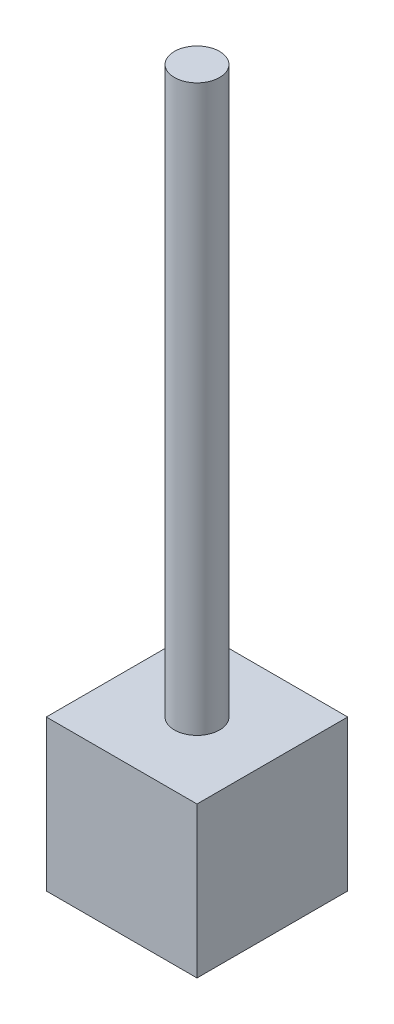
ISO-10303-21;
HEADER;
FILE_DESCRIPTION(('STEP AP214'),'2;1');
FILE_NAME('part.step','',(''),(''),'','','');
FILE_SCHEMA(('AUTOMOTIVE_DESIGN { 1 0 10303 214 1 1 1 1 }'));
ENDSEC;
DATA;
#1=APPLICATION_CONTEXT('core data for automotive mechanical design processes');
#2=APPLICATION_PROTOCOL_DEFINITION('international standard','automotive_design',2000,#1);
#3=PRODUCT_CONTEXT('',#1,'mechanical');
#4=PRODUCT('Part','Part','',(#3));
#5=PRODUCT_RELATED_PRODUCT_CATEGORY('part','',(#4));
#6=PRODUCT_DEFINITION_FORMATION('','',#4);
#7=PRODUCT_DEFINITION_CONTEXT('part definition',#1,'design');
#8=PRODUCT_DEFINITION('design','',#6,#7);
#9=PRODUCT_DEFINITION_SHAPE('','',#8);
#10=(LENGTH_UNIT() NAMED_UNIT(*) SI_UNIT(.MILLI.,.METRE.));
#11=(NAMED_UNIT(*) PLANE_ANGLE_UNIT() SI_UNIT($,.RADIAN.));
#12=(NAMED_UNIT(*) SI_UNIT($,.STERADIAN.) SOLID_ANGLE_UNIT());
#13=UNCERTAINTY_MEASURE_WITH_UNIT(LENGTH_MEASURE(1.E-05),#10,'distance_accuracy_value','');
#14=(GEOMETRIC_REPRESENTATION_CONTEXT(3) GLOBAL_UNCERTAINTY_ASSIGNED_CONTEXT((#13)) GLOBAL_UNIT_ASSIGNED_CONTEXT((#10,
#11,#12)) REPRESENTATION_CONTEXT('',''));
#15=CARTESIAN_POINT('',(0.,0.,0.));
#16=DIRECTION('',(0.,0.,1.));
#17=DIRECTION('',(1.,0.,0.));
#18=AXIS2_PLACEMENT_3D('',#15,#16,#17);
#19=CARTESIAN_POINT('',(0.,40.,40.));
#20=DIRECTION('',(0.,-1.,0.));
#21=DIRECTION('',(0.,0.,-1.));
#22=AXIS2_PLACEMENT_3D('',#19,#20,#21);
#23=PLANE('',#22);
#24=DIRECTION('',(-1.,0.,0.));
#25=VECTOR('',#24,1.);
#26=CARTESIAN_POINT('',(0.,40.,0.));
#27=LINE('',#26,#25);
#28=CARTESIAN_POINT('',(40.,40.,0.));
#29=VERTEX_POINT('',#28);
#30=CARTESIAN_POINT('',(0.,40.,0.));
#31=VERTEX_POINT('',#30);
#32=EDGE_CURVE('E94',#29,#31,#27,.T.);
#33=ORIENTED_EDGE('',*,*,#32,.T.);
#34=DIRECTION('',(0.,0.,-1.));
#35=VECTOR('',#34,1.);
#36=CARTESIAN_POINT('',(0.,40.,40.));
#37=LINE('',#36,#35);
#38=CARTESIAN_POINT('',(0.,40.,40.));
#39=VERTEX_POINT('',#38);
#40=EDGE_CURVE('E87',#39,#31,#37,.T.);
#41=ORIENTED_EDGE('',*,*,#40,.F.);
#42=DIRECTION('',(-1.,0.,0.));
#43=VECTOR('',#42,1.);
#44=CARTESIAN_POINT('',(0.,40.,40.));
#45=LINE('',#44,#43);
#46=CARTESIAN_POINT('',(40.,40.,40.));
#47=VERTEX_POINT('',#46);
#48=EDGE_CURVE('E43',#47,#39,#45,.T.);
#49=ORIENTED_EDGE('',*,*,#48,.F.);
#50=DIRECTION('',(0.,0.,-1.));
#51=VECTOR('',#50,1.);
#52=CARTESIAN_POINT('',(40.,40.,40.));
#53=LINE('',#52,#51);
#54=EDGE_CURVE('E102',#47,#29,#53,.T.);
#55=ORIENTED_EDGE('',*,*,#54,.T.);
#56=EDGE_LOOP('',(#33,#41,#49,#55));
#57=FACE_BOUND('',#56,.T.);
#58=CARTESIAN_POINT('',(20.,40.,20.));
#59=DIRECTION('',(0.,-1.,0.));
#60=DIRECTION('',(0.,0.,-1.));
#61=AXIS2_PLACEMENT_3D('',#58,#59,#60);
#62=CIRCLE('',#61,6.);
#63=CARTESIAN_POINT('',(20.,40.,14.));
#64=VERTEX_POINT('',#63);
#65=EDGE_CURVE('E11',#64,#64,#62,.F.);
#66=ORIENTED_EDGE('',*,*,#65,.F.);
#67=EDGE_LOOP('',(#66));
#68=FACE_BOUND('',#67,.T.);
#69=ADVANCED_FACE('F28',(#57,#68),#23,.F.);
#70=CARTESIAN_POINT('',(0.,0.,40.));
#71=DIRECTION('',(1.,0.,0.));
#72=DIRECTION('',(0.,0.,-1.));
#73=AXIS2_PLACEMENT_3D('',#70,#71,#72);
#74=PLANE('',#73);
#75=DIRECTION('',(0.,-1.,0.));
#76=VECTOR('',#75,1.);
#77=CARTESIAN_POINT('',(0.,0.,0.));
#78=LINE('',#77,#76);
#79=CARTESIAN_POINT('',(0.,0.,0.));
#80=VERTEX_POINT('',#79);
#81=EDGE_CURVE('E74',#31,#80,#78,.T.);
#82=ORIENTED_EDGE('',*,*,#81,.T.);
#83=DIRECTION('',(0.,0.,-1.));
#84=VECTOR('',#83,1.);
#85=CARTESIAN_POINT('',(0.,0.,40.));
#86=LINE('',#85,#84);
#87=CARTESIAN_POINT('',(0.,0.,40.));
#88=VERTEX_POINT('',#87);
#89=EDGE_CURVE('E36',#88,#80,#86,.T.);
#90=ORIENTED_EDGE('',*,*,#89,.F.);
#91=DIRECTION('',(0.,-1.,0.));
#92=VECTOR('',#91,1.);
#93=CARTESIAN_POINT('',(0.,0.,40.));
#94=LINE('',#93,#92);
#95=EDGE_CURVE('E96',#39,#88,#94,.T.);
#96=ORIENTED_EDGE('',*,*,#95,.F.);
#97=ORIENTED_EDGE('',*,*,#40,.T.);
#98=EDGE_LOOP('',(#82,#90,#96,#97));
#99=FACE_BOUND('',#98,.T.);
#100=ADVANCED_FACE('F30',(#99),#74,.F.);
#101=CARTESIAN_POINT('',(0.,0.,40.));
#102=DIRECTION('',(0.,1.,0.));
#103=DIRECTION('',(0.,0.,1.));
#104=AXIS2_PLACEMENT_3D('',#101,#102,#103);
#105=PLANE('',#104);
#106=DIRECTION('',(1.,0.,0.));
#107=VECTOR('',#106,1.);
#108=CARTESIAN_POINT('',(0.,0.,0.));
#109=LINE('',#108,#107);
#110=CARTESIAN_POINT('',(40.,0.,0.));
#111=VERTEX_POINT('',#110);
#112=EDGE_CURVE('E69',#80,#111,#109,.T.);
#113=ORIENTED_EDGE('',*,*,#112,.T.);
#114=DIRECTION('',(0.,0.,-1.));
#115=VECTOR('',#114,1.);
#116=CARTESIAN_POINT('',(40.,0.,40.));
#117=LINE('',#116,#115);
#118=CARTESIAN_POINT('',(40.,0.,40.));
#119=VERTEX_POINT('',#118);
#120=EDGE_CURVE('E85',#119,#111,#117,.T.);
#121=ORIENTED_EDGE('',*,*,#120,.F.);
#122=DIRECTION('',(1.,0.,0.));
#123=VECTOR('',#122,1.);
#124=CARTESIAN_POINT('',(0.,0.,40.));
#125=LINE('',#124,#123);
#126=EDGE_CURVE('E82',#88,#119,#125,.T.);
#127=ORIENTED_EDGE('',*,*,#126,.F.);
#128=ORIENTED_EDGE('',*,*,#89,.T.);
#129=EDGE_LOOP('',(#113,#121,#127,#128));
#130=FACE_BOUND('',#129,.T.);
#131=ADVANCED_FACE('F81',(#130),#105,.F.);
#132=CARTESIAN_POINT('',(40.,0.,40.));
#133=DIRECTION('',(-1.,0.,0.));
#134=DIRECTION('',(0.,0.,1.));
#135=AXIS2_PLACEMENT_3D('',#132,#133,#134);
#136=PLANE('',#135);
#137=DIRECTION('',(0.,1.,0.));
#138=VECTOR('',#137,1.);
#139=CARTESIAN_POINT('',(40.,0.,0.));
#140=LINE('',#139,#138);
#141=EDGE_CURVE('E75',#111,#29,#140,.T.);
#142=ORIENTED_EDGE('',*,*,#141,.T.);
#143=ORIENTED_EDGE('',*,*,#54,.F.);
#144=DIRECTION('',(0.,1.,0.));
#145=VECTOR('',#144,1.);
#146=CARTESIAN_POINT('',(40.,0.,40.));
#147=LINE('',#146,#145);
#148=EDGE_CURVE('E48',#119,#47,#147,.T.);
#149=ORIENTED_EDGE('',*,*,#148,.F.);
#150=ORIENTED_EDGE('',*,*,#120,.T.);
#151=EDGE_LOOP('',(#142,#143,#149,#150));
#152=FACE_BOUND('',#151,.T.);
#153=ADVANCED_FACE('F106',(#152),#136,.F.);
#154=CARTESIAN_POINT('',(0.,40.,40.));
#155=DIRECTION('',(0.,0.,-1.));
#156=DIRECTION('',(-1.,0.,0.));
#157=AXIS2_PLACEMENT_3D('',#154,#155,#156);
#158=PLANE('',#157);
#159=ORIENTED_EDGE('',*,*,#95,.T.);
#160=ORIENTED_EDGE('',*,*,#126,.T.);
#161=ORIENTED_EDGE('',*,*,#148,.T.);
#162=ORIENTED_EDGE('',*,*,#48,.T.);
#163=EDGE_LOOP('',(#159,#160,#161,#162));
#164=FACE_BOUND('',#163,.T.);
#165=ADVANCED_FACE('F109',(#164),#158,.F.);
#166=CARTESIAN_POINT('',(0.,40.,0.));
#167=DIRECTION('',(0.,0.,-1.));
#168=DIRECTION('',(-1.,0.,0.));
#169=AXIS2_PLACEMENT_3D('',#166,#167,#168);
#170=PLANE('',#169);
#171=ORIENTED_EDGE('',*,*,#81,.F.);
#172=ORIENTED_EDGE('',*,*,#32,.F.);
#173=ORIENTED_EDGE('',*,*,#141,.F.);
#174=ORIENTED_EDGE('',*,*,#112,.F.);
#175=EDGE_LOOP('',(#171,#172,#173,#174));
#176=FACE_BOUND('',#175,.T.);
#177=ADVANCED_FACE('F71',(#176),#170,.T.);
#178=CARTESIAN_POINT('',(20.,190.,20.));
#179=DIRECTION('',(0.,-1.,0.));
#180=DIRECTION('',(0.,0.,-1.));
#181=AXIS2_PLACEMENT_3D('',#178,#179,#180);
#182=CYLINDRICAL_SURFACE('',#181,6.);
#183=CARTESIAN_POINT('',(20.,190.,20.));
#184=DIRECTION('',(0.,1.,0.));
#185=DIRECTION('',(0.,0.,1.));
#186=AXIS2_PLACEMENT_3D('',#183,#184,#185);
#187=CIRCLE('',#186,6.);
#188=CARTESIAN_POINT('',(20.,190.,26.));
#189=VERTEX_POINT('',#188);
#190=EDGE_CURVE('E88',#189,#189,#187,.T.);
#191=ORIENTED_EDGE('',*,*,#190,.F.);
#192=EDGE_LOOP('',(#191));
#193=FACE_BOUND('',#192,.T.);
#194=ORIENTED_EDGE('',*,*,#65,.T.);
#195=EDGE_LOOP('',(#194));
#196=FACE_BOUND('',#195,.T.);
#197=ADVANCED_FACE('F116',(#193,#196),#182,.T.);
#198=CARTESIAN_POINT('',(20.,190.,20.));
#199=DIRECTION('',(0.,1.,0.));
#200=DIRECTION('',(0.,0.,1.));
#201=AXIS2_PLACEMENT_3D('',#198,#199,#200);
#202=PLANE('',#201);
#203=ORIENTED_EDGE('',*,*,#190,.T.);
#204=EDGE_LOOP('',(#203));
#205=FACE_BOUND('',#204,.T.);
#206=ADVANCED_FACE('F156',(#205),#202,.T.);
#207=CLOSED_SHELL('',(#69,#100,#131,#153,#165,#177,#197,#206));
#208=MANIFOLD_SOLID_BREP('B2',#207);
#209=ADVANCED_BREP_SHAPE_REPRESENTATION('',(#18,#208),#14);
#210=SHAPE_DEFINITION_REPRESENTATION(#9,#209);
ENDSEC;
END-ISO-10303-21;
